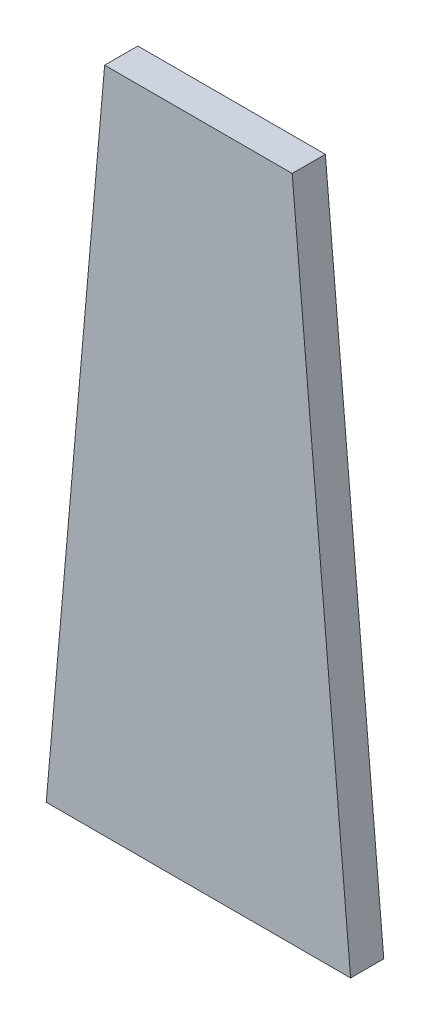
ISO-10303-21;
HEADER;
FILE_DESCRIPTION(('STEP AP214'),'2;1');
FILE_NAME('part.step','',(''),(''),'','','');
FILE_SCHEMA(('AUTOMOTIVE_DESIGN { 1 0 10303 214 1 1 1 1 }'));
ENDSEC;
DATA;
#1=APPLICATION_CONTEXT('core data for automotive mechanical design processes');
#2=APPLICATION_PROTOCOL_DEFINITION('international standard','automotive_design',2000,#1);
#3=PRODUCT_CONTEXT('',#1,'mechanical');
#4=PRODUCT('Part','Part','',(#3));
#5=PRODUCT_RELATED_PRODUCT_CATEGORY('part','',(#4));
#6=PRODUCT_DEFINITION_FORMATION('','',#4);
#7=PRODUCT_DEFINITION_CONTEXT('part definition',#1,'design');
#8=PRODUCT_DEFINITION('design','',#6,#7);
#9=PRODUCT_DEFINITION_SHAPE('','',#8);
#10=(LENGTH_UNIT() NAMED_UNIT(*) SI_UNIT(.MILLI.,.METRE.));
#11=(NAMED_UNIT(*) PLANE_ANGLE_UNIT() SI_UNIT($,.RADIAN.));
#12=(NAMED_UNIT(*) SI_UNIT($,.STERADIAN.) SOLID_ANGLE_UNIT());
#13=UNCERTAINTY_MEASURE_WITH_UNIT(LENGTH_MEASURE(1.E-05),#10,'distance_accuracy_value','');
#14=(GEOMETRIC_REPRESENTATION_CONTEXT(3) GLOBAL_UNCERTAINTY_ASSIGNED_CONTEXT((#13)) GLOBAL_UNIT_ASSIGNED_CONTEXT((#10,
#11,#12)) REPRESENTATION_CONTEXT('',''));
#15=CARTESIAN_POINT('',(0.,0.,0.));
#16=DIRECTION('',(0.,0.,1.));
#17=DIRECTION('',(1.,0.,0.));
#18=AXIS2_PLACEMENT_3D('',#15,#16,#17);
#19=CARTESIAN_POINT('',(-9.1740130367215,-20.121840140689,2.));
#20=DIRECTION('',(0.996194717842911,-0.0871555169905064,0.));
#21=DIRECTION('',(0.0871555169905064,0.996194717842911,0.));
#22=AXIS2_PLACEMENT_3D('',#19,#20,#21);
#23=PLANE('',#22);
#24=DIRECTION('',(-0.0871555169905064,-0.996194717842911,0.));
#25=VECTOR('',#24,1.);
#26=CARTESIAN_POINT('',(-9.1740130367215,-20.121840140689,0.));
#27=LINE('',#26,#25);
#28=CARTESIAN_POINT('',(-5.65315642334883,20.121840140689,0.));
#29=VERTEX_POINT('',#28);
#30=CARTESIAN_POINT('',(-9.1740130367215,-20.121840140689,0.));
#31=VERTEX_POINT('',#30);
#32=EDGE_CURVE('E97',#29,#31,#27,.T.);
#33=ORIENTED_EDGE('',*,*,#32,.T.);
#34=DIRECTION('',(0.,0.,-1.));
#35=VECTOR('',#34,1.);
#36=CARTESIAN_POINT('',(-9.1740130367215,-20.121840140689,2.));
#37=LINE('',#36,#35);
#38=CARTESIAN_POINT('',(-9.1740130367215,-20.121840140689,2.));
#39=VERTEX_POINT('',#38);
#40=EDGE_CURVE('E11',#39,#31,#37,.T.);
#41=ORIENTED_EDGE('',*,*,#40,.F.);
#42=DIRECTION('',(-0.0871555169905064,-0.996194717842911,0.));
#43=VECTOR('',#42,1.);
#44=CARTESIAN_POINT('',(-9.1740130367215,-20.121840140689,2.));
#45=LINE('',#44,#43);
#46=CARTESIAN_POINT('',(-5.65315642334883,20.121840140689,2.));
#47=VERTEX_POINT('',#46);
#48=EDGE_CURVE('E85',#47,#39,#45,.T.);
#49=ORIENTED_EDGE('',*,*,#48,.F.);
#50=DIRECTION('',(0.,0.,-1.));
#51=VECTOR('',#50,1.);
#52=CARTESIAN_POINT('',(-5.65315642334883,20.121840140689,2.));
#53=LINE('',#52,#51);
#54=EDGE_CURVE('E93',#47,#29,#53,.T.);
#55=ORIENTED_EDGE('',*,*,#54,.T.);
#56=EDGE_LOOP('',(#33,#41,#49,#55));
#57=FACE_BOUND('',#56,.T.);
#58=ADVANCED_FACE('F34',(#57),#23,.F.);
#59=CARTESIAN_POINT('',(9.1740130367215,-20.121840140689,2.));
#60=DIRECTION('',(0.,1.,0.));
#61=DIRECTION('',(0.,0.,1.));
#62=AXIS2_PLACEMENT_3D('',#59,#60,#61);
#63=PLANE('',#62);
#64=DIRECTION('',(1.,0.,0.));
#65=VECTOR('',#64,1.);
#66=CARTESIAN_POINT('',(9.1740130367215,-20.121840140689,0.));
#67=LINE('',#66,#65);
#68=CARTESIAN_POINT('',(9.1740130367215,-20.121840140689,0.));
#69=VERTEX_POINT('',#68);
#70=EDGE_CURVE('E89',#31,#69,#67,.T.);
#71=ORIENTED_EDGE('',*,*,#70,.T.);
#72=DIRECTION('',(0.,0.,-1.));
#73=VECTOR('',#72,1.);
#74=CARTESIAN_POINT('',(9.1740130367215,-20.121840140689,2.));
#75=LINE('',#74,#73);
#76=CARTESIAN_POINT('',(9.1740130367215,-20.121840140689,2.));
#77=VERTEX_POINT('',#76);
#78=EDGE_CURVE('E42',#77,#69,#75,.T.);
#79=ORIENTED_EDGE('',*,*,#78,.F.);
#80=DIRECTION('',(1.,0.,0.));
#81=VECTOR('',#80,1.);
#82=CARTESIAN_POINT('',(9.1740130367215,-20.121840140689,2.));
#83=LINE('',#82,#81);
#84=EDGE_CURVE('E80',#39,#77,#83,.T.);
#85=ORIENTED_EDGE('',*,*,#84,.F.);
#86=ORIENTED_EDGE('',*,*,#40,.T.);
#87=EDGE_LOOP('',(#71,#79,#85,#86));
#88=FACE_BOUND('',#87,.T.);
#89=ADVANCED_FACE('F88',(#88),#63,.F.);
#90=CARTESIAN_POINT('',(5.65315642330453,20.121840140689,2.));
#91=DIRECTION('',(-0.996194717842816,-0.0871555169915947,0.));
#92=DIRECTION('',(0.0871555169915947,-0.996194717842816,0.));
#93=AXIS2_PLACEMENT_3D('',#90,#91,#92);
#94=PLANE('',#93);
#95=DIRECTION('',(-0.0871555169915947,0.996194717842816,0.));
#96=VECTOR('',#95,1.);
#97=CARTESIAN_POINT('',(5.65315642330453,20.121840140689,0.));
#98=LINE('',#97,#96);
#99=CARTESIAN_POINT('',(5.65315642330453,20.121840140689,0.));
#100=VERTEX_POINT('',#99);
#101=EDGE_CURVE('E67',#69,#100,#98,.T.);
#102=ORIENTED_EDGE('',*,*,#101,.T.);
#103=DIRECTION('',(0.,0.,-1.));
#104=VECTOR('',#103,1.);
#105=CARTESIAN_POINT('',(5.65315642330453,20.121840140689,2.));
#106=LINE('',#105,#104);
#107=CARTESIAN_POINT('',(5.65315642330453,20.121840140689,2.));
#108=VERTEX_POINT('',#107);
#109=EDGE_CURVE('E90',#108,#100,#106,.T.);
#110=ORIENTED_EDGE('',*,*,#109,.F.);
#111=DIRECTION('',(-0.0871555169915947,0.996194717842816,0.));
#112=VECTOR('',#111,1.);
#113=CARTESIAN_POINT('',(5.65315642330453,20.121840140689,2.));
#114=LINE('',#113,#112);
#115=EDGE_CURVE('E83',#77,#108,#114,.T.);
#116=ORIENTED_EDGE('',*,*,#115,.F.);
#117=ORIENTED_EDGE('',*,*,#78,.T.);
#118=EDGE_LOOP('',(#102,#110,#116,#117));
#119=FACE_BOUND('',#118,.T.);
#120=ADVANCED_FACE('F91',(#119),#94,.F.);
#121=CARTESIAN_POINT('',(-5.65315642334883,20.121840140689,2.));
#122=DIRECTION('',(0.,-1.,0.));
#123=DIRECTION('',(0.,0.,-1.));
#124=AXIS2_PLACEMENT_3D('',#121,#122,#123);
#125=PLANE('',#124);
#126=DIRECTION('',(-1.,0.,0.));
#127=VECTOR('',#126,1.);
#128=CARTESIAN_POINT('',(-5.65315642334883,20.121840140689,0.));
#129=LINE('',#128,#127);
#130=EDGE_CURVE('E73',#100,#29,#129,.T.);
#131=ORIENTED_EDGE('',*,*,#130,.T.);
#132=ORIENTED_EDGE('',*,*,#54,.F.);
#133=DIRECTION('',(-1.,0.,0.));
#134=VECTOR('',#133,1.);
#135=CARTESIAN_POINT('',(-5.65315642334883,20.121840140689,2.));
#136=LINE('',#135,#134);
#137=EDGE_CURVE('E50',#108,#47,#136,.T.);
#138=ORIENTED_EDGE('',*,*,#137,.F.);
#139=ORIENTED_EDGE('',*,*,#109,.T.);
#140=EDGE_LOOP('',(#131,#132,#138,#139));
#141=FACE_BOUND('',#140,.T.);
#142=ADVANCED_FACE('F104',(#141),#125,.F.);
#143=CARTESIAN_POINT('',(0.,0.,2.));
#144=DIRECTION('',(0.,0.,-1.));
#145=DIRECTION('',(-1.,0.,0.));
#146=AXIS2_PLACEMENT_3D('',#143,#144,#145);
#147=PLANE('',#146);
#148=ORIENTED_EDGE('',*,*,#48,.T.);
#149=ORIENTED_EDGE('',*,*,#84,.T.);
#150=ORIENTED_EDGE('',*,*,#115,.T.);
#151=ORIENTED_EDGE('',*,*,#137,.T.);
#152=EDGE_LOOP('',(#148,#149,#150,#151));
#153=FACE_BOUND('',#152,.T.);
#154=ADVANCED_FACE('F81',(#153),#147,.F.);
#155=CARTESIAN_POINT('',(0.,0.,0.));
#156=DIRECTION('',(0.,0.,-1.));
#157=DIRECTION('',(-1.,0.,0.));
#158=AXIS2_PLACEMENT_3D('',#155,#156,#157);
#159=PLANE('',#158);
#160=ORIENTED_EDGE('',*,*,#32,.F.);
#161=ORIENTED_EDGE('',*,*,#130,.F.);
#162=ORIENTED_EDGE('',*,*,#101,.F.);
#163=ORIENTED_EDGE('',*,*,#70,.F.);
#164=EDGE_LOOP('',(#160,#161,#162,#163));
#165=FACE_BOUND('',#164,.T.);
#166=ADVANCED_FACE('F107',(#165),#159,.T.);
#167=CLOSED_SHELL('',(#58,#89,#120,#142,#154,#166));
#168=MANIFOLD_SOLID_BREP('B2',#167);
#169=ADVANCED_BREP_SHAPE_REPRESENTATION('',(#18,#168),#14);
#170=SHAPE_DEFINITION_REPRESENTATION(#9,#169);
ENDSEC;
END-ISO-10303-21;
